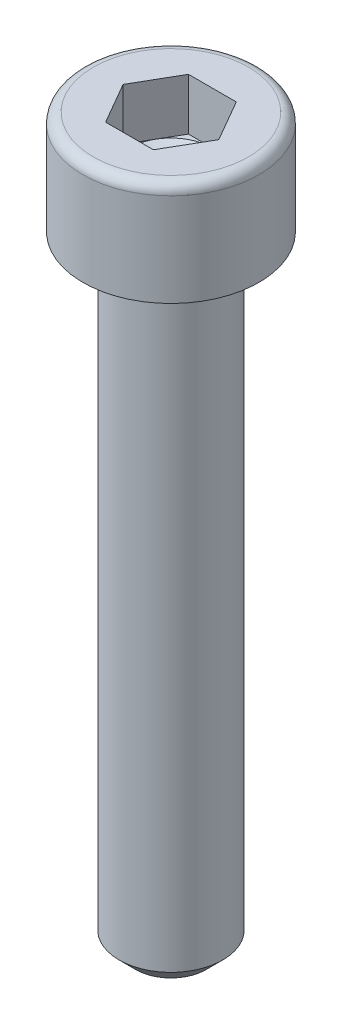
from build123d import *

# Parameters (mm, degrees)
TIGE_START              = -30
ESQUISSE1_R             = 2.5
TIGE_DEPTH              = 30
CHANFREIN_D_ENTR_E_SIZE = 0.8
HEXAGONE_DEPTH          = 2.5


with BuildPart() as part:
    # Esquisse1 → Tige (new body)
    with BuildSketch(Plane(origin=(0, 0, 0), x_dir=(1, 0, 0), z_dir=(0, 1, 0)).offset(TIGE_START)):
        with Locations(Location((0, 0, 0), (0, 0, 270))):
            Circle(ESQUISSE1_R)
    extrude(amount=TIGE_DEPTH)

    # Chanfrein d_entr_e
    chanfrein_d_entr_e_edges = [part.edges().sort_by_distance(p)[0] for p in [
        (0, -30, -2.5),
    ]]
    chamfer(chanfrein_d_entr_e_edges, length=CHANFREIN_D_ENTR_E_SIZE)

    # Esquisse2 → T_te (revolve)
    with BuildSketch(Plane.XY, mode=Mode.PRIVATE) as t_te_sk:
        with BuildLine():
            Line((2, 5), (2, 2.5))
            Line((2, 2.5), (0, 1.345299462))
            Line((0, 1.345299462), (0, 0))
            Line((0, 0), (4.25, 0))
            Line((4.25, 0), (4.25, 4.5))
            ThreePointArc((4.25, 4.5), (4.103553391, 4.853553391), (3.75, 5))
            Line((3.75, 5), (2, 5))
        make_face()
    revolve(t_te_sk.sketch.rotate(Axis((0, 5, 0), (0, -1, 0)), 180), axis=Axis((0, 5, 0), (0, -1, 0)))

    # Esquisse3 → Hexagone (cut)
    with BuildSketch(Plane(origin=(0, 5, -3), x_dir=(1, 0, 0), z_dir=(0, -1, 0))):
        Polygon((1.154700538, 5), (-1.154700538, 5), (-2.309401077, 3), (-1.154700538, 1), (1.154700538, 1), (2.309401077, 3), align=None)
    extrude(amount=HEXAGONE_DEPTH, mode=Mode.SUBTRACT)


solid = part.part
